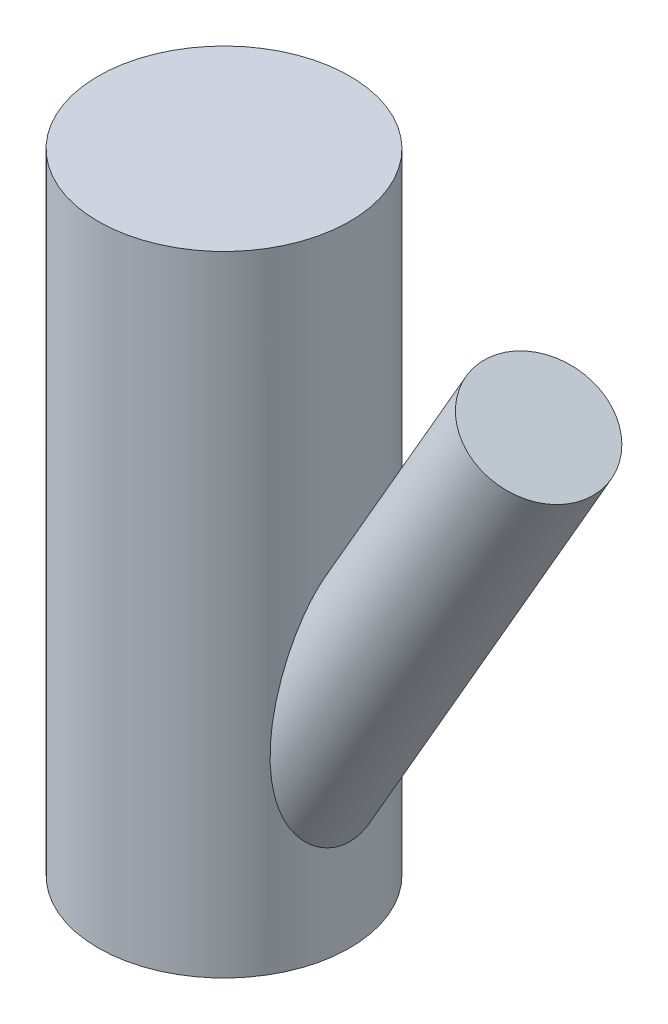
ISO-10303-21;
HEADER;
FILE_DESCRIPTION(('STEP AP214'),'2;1');
FILE_NAME('part.step','',(''),(''),'','','');
FILE_SCHEMA(('AUTOMOTIVE_DESIGN { 1 0 10303 214 1 1 1 1 }'));
ENDSEC;
DATA;
#1=APPLICATION_CONTEXT('core data for automotive mechanical design processes');
#2=APPLICATION_PROTOCOL_DEFINITION('international standard','automotive_design',2000,#1);
#3=PRODUCT_CONTEXT('',#1,'mechanical');
#4=PRODUCT('Part','Part','',(#3));
#5=PRODUCT_RELATED_PRODUCT_CATEGORY('part','',(#4));
#6=PRODUCT_DEFINITION_FORMATION('','',#4);
#7=PRODUCT_DEFINITION_CONTEXT('part definition',#1,'design');
#8=PRODUCT_DEFINITION('design','',#6,#7);
#9=PRODUCT_DEFINITION_SHAPE('','',#8);
#10=(LENGTH_UNIT() NAMED_UNIT(*) SI_UNIT(.MILLI.,.METRE.));
#11=(NAMED_UNIT(*) PLANE_ANGLE_UNIT() SI_UNIT($,.RADIAN.));
#12=(NAMED_UNIT(*) SI_UNIT($,.STERADIAN.) SOLID_ANGLE_UNIT());
#13=UNCERTAINTY_MEASURE_WITH_UNIT(LENGTH_MEASURE(1.E-05),#10,'distance_accuracy_value','');
#14=(GEOMETRIC_REPRESENTATION_CONTEXT(3) GLOBAL_UNCERTAINTY_ASSIGNED_CONTEXT((#13)) GLOBAL_UNIT_ASSIGNED_CONTEXT((#10,
#11,#12)) REPRESENTATION_CONTEXT('',''));
#15=CARTESIAN_POINT('',(0.,0.,0.));
#16=DIRECTION('',(0.,0.,1.));
#17=DIRECTION('',(1.,0.,0.));
#18=AXIS2_PLACEMENT_3D('',#15,#16,#17);
#19=CARTESIAN_POINT('',(0.,50.,0.));
#20=DIRECTION('',(0.,-1.,0.));
#21=DIRECTION('',(0.,0.,-1.));
#22=AXIS2_PLACEMENT_3D('',#19,#20,#21);
#23=CYLINDRICAL_SURFACE('',#22,10.);
#24=CARTESIAN_POINT('',(0.,0.,0.));
#25=DIRECTION('',(0.,1.,0.));
#26=DIRECTION('',(0.,0.,1.));
#27=AXIS2_PLACEMENT_3D('',#24,#25,#26);
#28=CIRCLE('',#27,10.);
#29=CARTESIAN_POINT('',(0.,0.,10.));
#30=VERTEX_POINT('',#29);
#31=EDGE_CURVE('E45',#30,#30,#28,.T.);
#32=ORIENTED_EDGE('',*,*,#31,.T.);
#33=EDGE_LOOP('',(#32));
#34=FACE_BOUND('',#33,.T.);
#35=CARTESIAN_POINT('',(0.,50.,0.));
#36=DIRECTION('',(0.,1.,0.));
#37=DIRECTION('',(0.,0.,1.));
#38=AXIS2_PLACEMENT_3D('',#35,#36,#37);
#39=CIRCLE('',#38,10.);
#40=CARTESIAN_POINT('',(0.,50.,10.));
#41=VERTEX_POINT('',#40);
#42=EDGE_CURVE('E41',#41,#41,#39,.T.);
#43=ORIENTED_EDGE('',*,*,#42,.F.);
#44=EDGE_LOOP('',(#43));
#45=FACE_BOUND('',#44,.T.);
#46=CARTESIAN_POINT('',(9.99999999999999,7.32050807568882,0.));
#47=CARTESIAN_POINT('',(10.0000003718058,7.3205077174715,-0.116801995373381));
#48=CARTESIAN_POINT('',(9.99794929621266,7.32515154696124,-0.233597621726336));
#49=CARTESIAN_POINT('',(9.98979875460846,7.34369654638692,-0.466350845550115));
#50=CARTESIAN_POINT('',(9.98369795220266,7.35760077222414,-0.582308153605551));
#51=CARTESIAN_POINT('',(9.96759885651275,7.39459035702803,-0.81259531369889));
#52=CARTESIAN_POINT('',(9.95759655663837,7.41768515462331,-0.926923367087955));
#53=CARTESIAN_POINT('',(9.9339531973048,7.47289764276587,-1.15304018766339));
#54=CARTESIAN_POINT('',(9.92031073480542,7.50501881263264,-1.26482795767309));
#55=CARTESIAN_POINT('',(9.8897841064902,7.57794221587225,-1.48474336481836));
#56=CARTESIAN_POINT('',(9.87290858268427,7.61872133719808,-1.59287987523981));
#57=CARTESIAN_POINT('',(9.83631577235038,7.70870982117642,-1.8051306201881));
#58=CARTESIAN_POINT('',(9.81659741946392,7.75792234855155,-1.90924332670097));
#59=CARTESIAN_POINT('',(9.77482621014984,7.86434236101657,-2.11271144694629));
#60=CARTESIAN_POINT('',(9.75277504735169,7.92154405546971,-2.21207023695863));
#61=CARTESIAN_POINT('',(9.70685022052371,8.04350257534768,-2.40561148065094));
#62=CARTESIAN_POINT('',(9.68297588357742,8.10826219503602,-2.49979200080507));
#63=CARTESIAN_POINT('',(9.60809810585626,8.31683691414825,-2.77887698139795));
#64=CARTESIAN_POINT('',(9.55500764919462,8.47207194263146,-2.95484904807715));
#65=CARTESIAN_POINT('',(9.44796559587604,8.80708339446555,-3.28109578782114));
#66=CARTESIAN_POINT('',(9.39401361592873,8.98687102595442,-3.4313586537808));
#67=CARTESIAN_POINT('',(9.30300772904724,9.3147375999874,-3.66955472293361));
#68=CARTESIAN_POINT('',(9.2652979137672,9.45841362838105,-3.76340323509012));
#69=CARTESIAN_POINT('',(9.19238719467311,9.75409722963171,-3.93814598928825));
#70=CARTESIAN_POINT('',(9.15718727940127,9.90610804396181,-4.01903514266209));
#71=CARTESIAN_POINT('',(9.08998946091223,10.2168633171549,-4.16879369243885));
#72=CARTESIAN_POINT('',(9.05799641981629,10.3756174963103,-4.23764495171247));
#73=CARTESIAN_POINT('',(8.99768636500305,10.6981971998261,-4.36423386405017));
#74=CARTESIAN_POINT('',(8.96937068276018,10.8620245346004,-4.42196749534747));
#75=CARTESIAN_POINT('',(8.90075802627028,11.2932974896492,-4.55911478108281));
#76=CARTESIAN_POINT('',(8.86351150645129,11.5637433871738,-4.63065371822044));
#77=CARTESIAN_POINT('',(8.79901153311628,12.1106325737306,-4.75205803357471));
#78=CARTESIAN_POINT('',(8.77176480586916,12.3870797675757,-4.80190882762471));
#79=CARTESIAN_POINT('',(8.72657840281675,12.9441876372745,-4.88354340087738));
#80=CARTESIAN_POINT('',(8.70866768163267,13.2248586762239,-4.91527100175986));
#81=CARTESIAN_POINT('',(8.68140458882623,13.7878246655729,-4.96326059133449));
#82=CARTESIAN_POINT('',(8.67205079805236,14.070119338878,-4.97952514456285));
#83=CARTESIAN_POINT('',(8.66103368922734,14.6313274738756,-4.9986601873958));
#84=CARTESIAN_POINT('',(8.65926485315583,14.9102331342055,-5.00171445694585));
#85=CARTESIAN_POINT('',(8.66226564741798,15.4679357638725,-4.99651444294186));
#86=CARTESIAN_POINT('',(8.66703659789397,15.7467326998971,-4.98825787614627));
#87=CARTESIAN_POINT('',(8.68233428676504,16.3039291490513,-4.96158282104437));
#88=CARTESIAN_POINT('',(8.69286645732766,16.5823280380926,-4.94315474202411));
#89=CARTESIAN_POINT('',(8.71897818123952,17.1380807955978,-4.89695025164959));
#90=CARTESIAN_POINT('',(8.73455738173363,17.4154347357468,-4.86917449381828));
#91=CARTESIAN_POINT('',(8.77011439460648,17.968537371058,-4.80483532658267));
#92=CARTESIAN_POINT('',(8.7900876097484,18.2442874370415,-4.7682810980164));
#93=CARTESIAN_POINT('',(8.83388588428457,18.7942224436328,-4.68664133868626));
#94=CARTESIAN_POINT('',(8.85771109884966,19.068407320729,-4.64155546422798));
#95=CARTESIAN_POINT('',(8.90869696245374,19.6147308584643,-4.54292844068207));
#96=CARTESIAN_POINT('',(8.93585517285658,19.8868708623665,-4.48939346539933));
#97=CARTESIAN_POINT('',(8.99306920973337,20.4289734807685,-4.3736573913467));
#98=CARTESIAN_POINT('',(9.02312475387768,20.6989363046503,-4.3114571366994));
#99=CARTESIAN_POINT('',(9.07817694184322,21.1715623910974,-4.1940231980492));
#100=CARTESIAN_POINT('',(9.10264764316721,21.3747685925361,-4.14072195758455));
#101=CARTESIAN_POINT('',(9.15284370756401,21.7794806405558,-4.02855191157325));
#102=CARTESIAN_POINT('',(9.1785690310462,21.9809865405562,-3.96968328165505));
#103=CARTESIAN_POINT('',(9.23112317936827,22.3821966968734,-3.84589300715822));
#104=CARTESIAN_POINT('',(9.25795299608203,22.5818991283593,-3.78096585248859));
#105=CARTESIAN_POINT('',(9.31250941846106,22.9789166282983,-3.64452576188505));
#106=CARTESIAN_POINT('',(9.34023599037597,23.1762317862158,-3.5730130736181));
#107=CARTESIAN_POINT('',(9.39899779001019,23.5861663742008,-3.41563308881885));
#108=CARTESIAN_POINT('',(9.43010094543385,23.798502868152,-3.32904934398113));
#109=CARTESIAN_POINT('',(9.49284576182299,24.2187753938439,-3.14567751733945));
#110=CARTESIAN_POINT('',(9.5244876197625,24.4267097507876,-3.04888563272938));
#111=CARTESIAN_POINT('',(9.58780046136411,24.8358971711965,-2.84352001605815));
#112=CARTESIAN_POINT('',(9.61947104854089,25.03716899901,-2.73498385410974));
#113=CARTESIAN_POINT('',(9.68235896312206,25.4310881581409,-2.50327521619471));
#114=CARTESIAN_POINT('',(9.71357670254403,25.623743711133,-2.3801171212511));
#115=CARTESIAN_POINT('',(9.76571951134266,25.9415789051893,-2.15404634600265));
#116=CARTESIAN_POINT('',(9.78697965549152,26.0699859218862,-2.05577907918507));
#117=CARTESIAN_POINT('',(9.82835320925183,26.3179454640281,-1.84790081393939));
#118=CARTESIAN_POINT('',(9.84846495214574,26.4374851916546,-1.73827394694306));
#119=CARTESIAN_POINT('',(9.88691194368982,26.664503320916,-1.5043948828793));
#120=CARTESIAN_POINT('',(9.90522655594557,26.7718434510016,-1.38000252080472));
#121=CARTESIAN_POINT('',(9.93848008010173,26.9657249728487,-1.11545488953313));
#122=CARTESIAN_POINT('',(9.95342932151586,27.0523300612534,-0.975349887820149));
#123=CARTESIAN_POINT('',(9.97353199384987,27.1684062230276,-0.733198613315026));
#124=CARTESIAN_POINT('',(9.98027142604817,27.207204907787,-0.63580040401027));
#125=CARTESIAN_POINT('',(9.99099281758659,27.2688472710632,-0.435929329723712));
#126=CARTESIAN_POINT('',(9.99497844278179,27.2917121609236,-0.33346340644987));
#127=CARTESIAN_POINT('',(9.99975924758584,27.3191318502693,-0.125301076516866));
#128=CARTESIAN_POINT('',(10.000534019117,27.3235695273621,-0.0195882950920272));
#129=CARTESIAN_POINT('',(9.99873242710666,27.3132416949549,0.190882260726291));
#130=CARTESIAN_POINT('',(9.99615472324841,27.2984685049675,0.295639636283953));
#131=CARTESIAN_POINT('',(9.98826646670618,27.2531761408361,0.493636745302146));
#132=CARTESIAN_POINT('',(9.98316258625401,27.2238473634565,0.587166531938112));
#133=CARTESIAN_POINT('',(9.9707985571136,27.1526299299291,0.769091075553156));
#134=CARTESIAN_POINT('',(9.96353755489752,27.1107363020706,0.857483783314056));
#135=CARTESIAN_POINT('',(9.94132375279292,26.982182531,1.09202775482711));
#136=CARTESIAN_POINT('',(9.92465943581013,26.8853603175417,1.23241409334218));
#137=CARTESIAN_POINT('',(9.88821714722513,26.6721388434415,1.49704047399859));
#138=CARTESIAN_POINT('',(9.86842798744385,26.5556691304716,1.62121945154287));
#139=CARTESIAN_POINT('',(9.82724891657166,26.3113438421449,1.85445515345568));
#140=CARTESIAN_POINT('',(9.80587851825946,26.1836242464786,1.96366020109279));
#141=CARTESIAN_POINT('',(9.76208362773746,25.9195326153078,2.17093257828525));
#142=CARTESIAN_POINT('',(9.73965806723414,25.7831517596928,2.26898826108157));
#143=CARTESIAN_POINT('',(9.69421023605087,25.5040067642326,2.4559204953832));
#144=CARTESIAN_POINT('',(9.67118690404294,25.3612308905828,2.54477909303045));
#145=CARTESIAN_POINT('',(9.62492132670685,25.0711695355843,2.71451812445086));
#146=CARTESIAN_POINT('',(9.60167917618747,24.9238859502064,2.79540185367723));
#147=CARTESIAN_POINT('',(9.54360666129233,24.5514476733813,2.9890331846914));
#148=CARTESIAN_POINT('',(9.50877897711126,24.3240964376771,3.09754965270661));
#149=CARTESIAN_POINT('',(9.43969264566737,23.8637129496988,3.30209276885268));
#150=CARTESIAN_POINT('',(9.40543425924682,23.630678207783,3.39811382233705));
#151=CARTESIAN_POINT('',(9.33785430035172,23.1599705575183,3.57964613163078));
#152=CARTESIAN_POINT('',(9.30453444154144,22.9222903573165,3.66513901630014));
#153=CARTESIAN_POINT('',(9.23924623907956,22.4436384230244,3.82673645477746));
#154=CARTESIAN_POINT('',(9.20727768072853,22.2026672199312,3.90284250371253));
#155=CARTESIAN_POINT('',(9.14479973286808,21.7164572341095,4.04707918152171));
#156=CARTESIAN_POINT('',(9.11430106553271,21.4712009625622,4.11515529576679));
#157=CARTESIAN_POINT('',(9.05529525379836,20.9783938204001,4.24341931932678));
#158=CARTESIAN_POINT('',(9.02678817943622,20.7308428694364,4.30360695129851));
#159=CARTESIAN_POINT('',(8.9721125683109,20.2340457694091,4.41646024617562));
#160=CARTESIAN_POINT('',(8.94594168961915,19.9848015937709,4.46913347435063));
#161=CARTESIAN_POINT('',(8.89624205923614,19.4846345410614,4.56726398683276));
#162=CARTESIAN_POINT('',(8.87271332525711,19.2337116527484,4.61272122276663));
#163=CARTESIAN_POINT('',(8.82735619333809,18.7154841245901,4.69896750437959));
#164=CARTESIAN_POINT('',(8.80571139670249,18.4480905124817,4.73931980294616));
#165=CARTESIAN_POINT('',(8.76627489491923,17.9119073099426,4.81187372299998));
#166=CARTESIAN_POINT('',(8.74848327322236,17.6431176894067,4.84407516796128));
#167=CARTESIAN_POINT('',(8.71727442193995,17.1041007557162,4.90001576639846));
#168=CARTESIAN_POINT('',(8.70386199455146,16.8338721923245,4.92374563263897));
#169=CARTESIAN_POINT('',(8.68204575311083,16.2925666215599,4.9621135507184));
#170=CARTESIAN_POINT('',(8.6736417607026,16.0214896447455,4.97675192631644));
#171=CARTESIAN_POINT('',(8.66257333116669,15.4813242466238,4.99599324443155));
#172=CARTESIAN_POINT('',(8.65985723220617,15.2122402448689,5.00068652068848));
#173=CARTESIAN_POINT('',(8.66074442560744,14.6740485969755,4.99915138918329));
#174=CARTESIAN_POINT('',(8.66434863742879,14.4049409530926,4.99292139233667));
#175=CARTESIAN_POINT('',(8.67865381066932,13.8679694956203,4.96801561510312));
#176=CARTESIAN_POINT('',(8.68934144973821,13.6001042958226,4.94936319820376));
#177=CARTESIAN_POINT('',(8.7186006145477,13.0662550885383,4.89764411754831));
#178=CARTESIAN_POINT('',(8.73716836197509,12.8002702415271,4.8645843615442));
#179=CARTESIAN_POINT('',(8.77438068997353,12.3702056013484,4.79698873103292));
#180=CARTESIAN_POINT('',(8.79041842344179,12.2050859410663,4.76759340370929));
#181=CARTESIAN_POINT('',(8.82601328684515,11.8767095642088,4.70137347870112));
#182=CARTESIAN_POINT('',(8.84557034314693,11.7134528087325,4.66454903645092));
#183=CARTESIAN_POINT('',(8.88830163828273,11.3893113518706,4.5826010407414));
#184=CARTESIAN_POINT('',(8.91147968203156,11.2284293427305,4.53746874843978));
#185=CARTESIAN_POINT('',(8.96141792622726,10.9100679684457,4.43802739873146));
#186=CARTESIAN_POINT('',(8.98817815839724,10.7525886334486,4.38371826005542));
#187=CARTESIAN_POINT('',(9.04541005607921,10.4405295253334,4.26438538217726));
#188=CARTESIAN_POINT('',(9.07591643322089,10.285995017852,4.19925909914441));
#189=CARTESIAN_POINT('',(9.14006795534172,9.98280161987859,4.05773265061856));
#190=CARTESIAN_POINT('',(9.17371329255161,9.83414309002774,3.98133179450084));
#191=CARTESIAN_POINT('',(9.24347862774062,9.54451312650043,3.81655521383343));
#192=CARTESIAN_POINT('',(9.27959461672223,9.40352987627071,3.72819867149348));
#193=CARTESIAN_POINT('',(9.35345194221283,9.13079613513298,3.53882107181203));
#194=CARTESIAN_POINT('',(9.39119271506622,8.99904248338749,3.43780438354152));
#195=CARTESIAN_POINT('',(9.45767206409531,8.77802131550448,3.24957954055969));
#196=CARTESIAN_POINT('',(9.48631786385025,8.6863302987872,3.16517515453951));
#197=CARTESIAN_POINT('',(9.54324623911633,8.51004635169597,2.98914772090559));
#198=CARTESIAN_POINT('',(9.57152888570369,8.42545201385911,2.89752611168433));
#199=CARTESIAN_POINT('',(9.62707362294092,8.26412911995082,2.70726306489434));
#200=CARTESIAN_POINT('',(9.65433548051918,8.18740235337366,2.60862003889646));
#201=CARTESIAN_POINT('',(9.70712678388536,8.04258028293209,2.40474001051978));
#202=CARTESIAN_POINT('',(9.73265622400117,7.97448500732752,2.29950298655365));
#203=CARTESIAN_POINT('',(9.78141808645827,7.84721965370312,2.08238064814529));
#204=CARTESIAN_POINT('',(9.8046360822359,7.78810455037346,1.97045980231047));
#205=CARTESIAN_POINT('',(9.84791581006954,7.67986767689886,1.7413058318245));
#206=CARTESIAN_POINT('',(9.86797780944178,7.63074506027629,1.62407315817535));
#207=CARTESIAN_POINT('',(9.90430881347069,7.54301870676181,1.3853589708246));
#208=CARTESIAN_POINT('',(9.92058325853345,7.50439986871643,1.26388384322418));
#209=CARTESIAN_POINT('',(9.94886292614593,7.43795679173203,1.01758680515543));
#210=CARTESIAN_POINT('',(9.96087005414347,7.41012773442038,0.892766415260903));
#211=CARTESIAN_POINT('',(9.98026739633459,7.36543753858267,0.640542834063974));
#212=CARTESIAN_POINT('',(9.98764757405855,7.34860023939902,0.513134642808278));
#213=CARTESIAN_POINT('',(9.99751352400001,7.3261360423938,0.257148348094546));
#214=CARTESIAN_POINT('',(9.99999959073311,7.32050846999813,0.128570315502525));
#215=CARTESIAN_POINT('',(9.99999999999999,7.32050807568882,0.));
#216=B_SPLINE_CURVE_WITH_KNOTS('',3,(#46,#47,#48,#49,#50,#51,#52,#53,#54,#55,#56,#57,#58,#59,
#60,#61,#62,#63,#64,#65,#66,#67,#68,#69,#70,#71,#72,#73,#74,#75,#76,#77,#78,#79,#80,#81,#82,#83,
#84,#85,#86,#87,#88,#89,#90,#91,#92,#93,#94,#95,#96,#97,#98,#99,#100,#101,#102,#103,#104,#105,
#106,#107,#108,#109,#110,#111,#112,#113,#114,#115,#116,#117,#118,#119,#120,#121,#122,#123,#124,
#125,#126,#127,#128,#129,#130,#131,#132,#133,#134,#135,#136,#137,#138,#139,#140,#141,#142,#143,
#144,#145,#146,#147,#148,#149,#150,#151,#152,#153,#154,#155,#156,#157,#158,#159,#160,#161,#162,
#163,#164,#165,#166,#167,#168,#169,#170,#171,#172,#173,#174,#175,#176,#177,#178,#179,#180,#181,
#182,#183,#184,#185,#186,#187,#188,#189,#190,#191,#192,#193,#194,#195,#196,#197,#198,#199,#200,
#201,#202,#203,#204,#205,#206,#207,#208,#209,#210,#211,#212,#213,#214,#215),.UNSPECIFIED.,.T.,
.F.,(4,2,2,2,2,2,2,2,2,2,2,2,2,2,2,2,2,2,2,2,2,2,2,2,2,2,2,2,2,2,2,2,2,2,2,2,2,2,2,2,2,2,2,2,2,
2,2,2,2,2,2,2,2,2,2,2,2,2,2,2,2,2,2,2,2,2,2,2,2,2,2,2,2,2,2,2,2,2,2,2,2,2,2,2,4),(0.,
0.350285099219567,0.700685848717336,1.05144738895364,1.40234432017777,1.75231606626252,
2.10241943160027,2.45227034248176,2.80225101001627,3.52087996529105,4.23983807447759,
4.76625140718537,5.29287093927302,5.82027720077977,6.34787389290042,7.19311900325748,
8.03893162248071,8.88735206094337,9.73563176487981,10.5720715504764,11.4086802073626,
12.2460790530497,13.0834193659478,13.9198877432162,14.7563898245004,15.5922834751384,
16.4280957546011,17.0625232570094,17.6969307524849,18.3319209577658,18.9668872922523,
19.660895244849,20.3551626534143,21.0472713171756,21.7387048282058,22.2274907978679,
22.7169690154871,23.2115345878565,23.7045608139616,24.0186039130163,24.3322281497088,
24.6478427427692,24.9635835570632,25.2569428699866,25.5504184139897,26.0614765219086,
26.5744077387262,27.081820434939,27.589758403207,28.0986699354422,28.6073702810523,
29.3698191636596,30.1326082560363,30.8967100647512,31.6606900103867,32.4295896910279,
33.1985163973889,33.9666634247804,34.7348156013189,35.5485248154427,36.3622516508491,
37.1768678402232,37.9914550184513,38.7986108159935,39.6058840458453,40.4116432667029,
41.217016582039,41.7222820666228,42.2275369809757,42.733326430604,43.2391203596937,
43.7500157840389,44.2609425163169,44.7710590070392,45.2809999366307,45.6642600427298,
46.0474439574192,46.4307148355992,46.8139869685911,47.199518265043,47.585016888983,
47.969958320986,48.354727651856,48.7403287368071,49.1259066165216),.UNSPECIFIED.);
#217=CARTESIAN_POINT('',(9.99999999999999,7.32050807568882,0.));
#218=VERTEX_POINT('',#217);
#219=EDGE_CURVE('E10',#218,#218,#216,.T.);
#220=ORIENTED_EDGE('',*,*,#219,.F.);
#221=EDGE_LOOP('',(#220));
#222=FACE_BOUND('',#221,.T.);
#223=ADVANCED_FACE('F31',(#34,#45,#222),#23,.T.);
#224=CARTESIAN_POINT('',(0.,50.,0.));
#225=DIRECTION('',(0.,1.,0.));
#226=DIRECTION('',(0.,0.,1.));
#227=AXIS2_PLACEMENT_3D('',#224,#225,#226);
#228=PLANE('',#227);
#229=ORIENTED_EDGE('',*,*,#42,.T.);
#230=EDGE_LOOP('',(#229));
#231=FACE_BOUND('',#230,.T.);
#232=ADVANCED_FACE('F65',(#231),#228,.T.);
#233=CARTESIAN_POINT('',(0.,0.,0.));
#234=DIRECTION('',(0.,1.,0.));
#235=DIRECTION('',(0.,0.,1.));
#236=AXIS2_PLACEMENT_3D('',#233,#234,#235);
#237=PLANE('',#236);
#238=ORIENTED_EDGE('',*,*,#31,.F.);
#239=EDGE_LOOP('',(#238));
#240=FACE_BOUND('',#239,.T.);
#241=ADVANCED_FACE('F63',(#240),#237,.F.);
#242=CARTESIAN_POINT('',(0.,0.,0.));
#243=DIRECTION('',(-0.499999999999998,-0.86602540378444,0.));
#244=DIRECTION('',(0.86602540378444,-0.499999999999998,0.));
#245=AXIS2_PLACEMENT_3D('',#242,#243,#244);
#246=CYLINDRICAL_SURFACE('',#245,5.);
#247=CARTESIAN_POINT('',(24.9999999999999,43.301270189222,0.));
#248=DIRECTION('',(-0.499999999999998,-0.86602540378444,0.));
#249=DIRECTION('',(0.86602540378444,-0.499999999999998,0.));
#250=AXIS2_PLACEMENT_3D('',#247,#248,#249);
#251=CIRCLE('',#250,5.00000000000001);
#252=CARTESIAN_POINT('',(29.3301270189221,40.801270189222,0.));
#253=VERTEX_POINT('',#252);
#254=EDGE_CURVE('E49',#253,#253,#251,.T.);
#255=ORIENTED_EDGE('',*,*,#254,.T.);
#256=EDGE_LOOP('',(#255));
#257=FACE_BOUND('',#256,.T.);
#258=ORIENTED_EDGE('',*,*,#219,.T.);
#259=EDGE_LOOP('',(#258));
#260=FACE_BOUND('',#259,.T.);
#261=ADVANCED_FACE('F55',(#257,#260),#246,.T.);
#262=CARTESIAN_POINT('',(24.9999999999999,43.3012701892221,0.));
#263=DIRECTION('',(-0.499999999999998,-0.86602540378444,0.));
#264=DIRECTION('',(0.86602540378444,-0.499999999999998,0.));
#265=AXIS2_PLACEMENT_3D('',#262,#263,#264);
#266=PLANE('',#265);
#267=ORIENTED_EDGE('',*,*,#254,.F.);
#268=EDGE_LOOP('',(#267));
#269=FACE_BOUND('',#268,.T.);
#270=ADVANCED_FACE('F57',(#269),#266,.F.);
#271=CLOSED_SHELL('',(#223,#232,#241,#261,#270));
#272=MANIFOLD_SOLID_BREP('B2',#271);
#273=ADVANCED_BREP_SHAPE_REPRESENTATION('',(#18,#272),#14);
#274=SHAPE_DEFINITION_REPRESENTATION(#9,#273);
ENDSEC;
END-ISO-10303-21;
